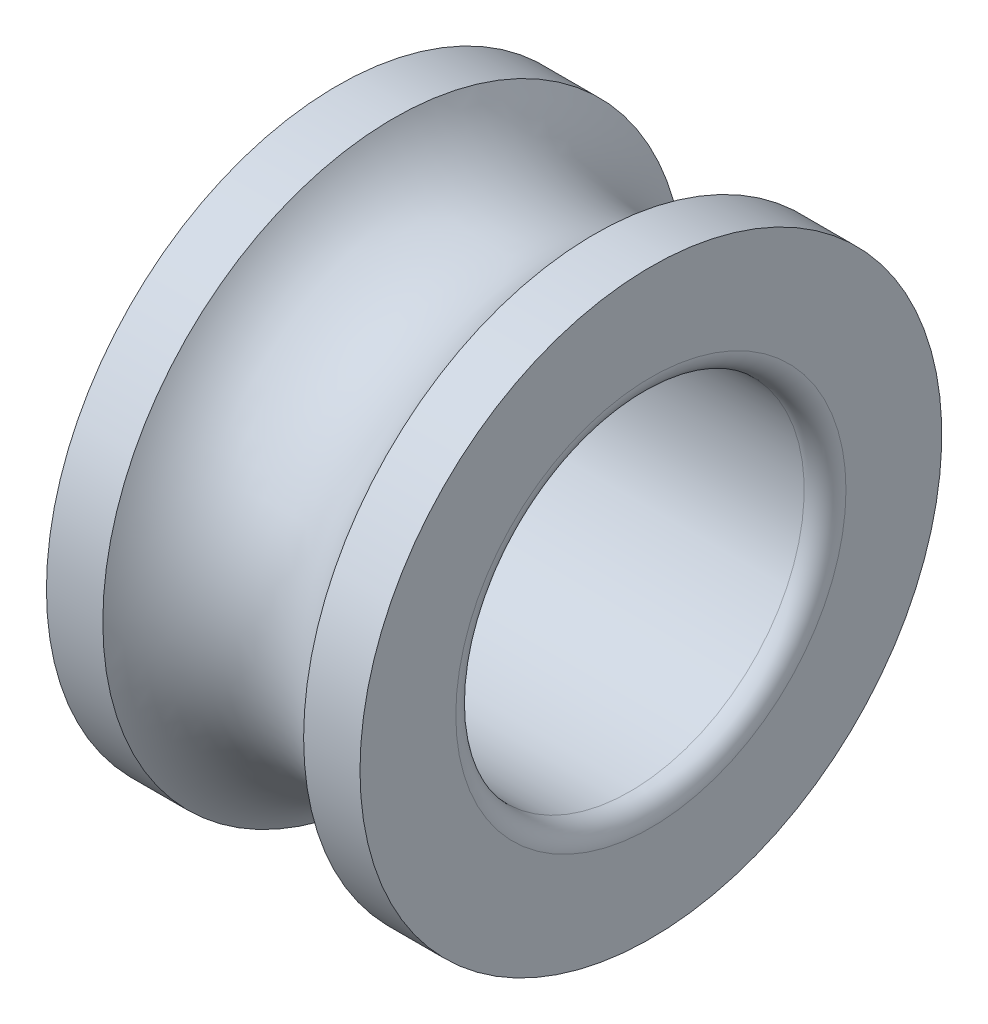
ISO-10303-21;
HEADER;
FILE_DESCRIPTION(('STEP AP214'),'2;1');
FILE_NAME('part.step','',(''),(''),'','','');
FILE_SCHEMA(('AUTOMOTIVE_DESIGN { 1 0 10303 214 1 1 1 1 }'));
ENDSEC;
DATA;
#1=APPLICATION_CONTEXT('core data for automotive mechanical design processes');
#2=APPLICATION_PROTOCOL_DEFINITION('international standard','automotive_design',2000,#1);
#3=PRODUCT_CONTEXT('',#1,'mechanical');
#4=PRODUCT('Part','Part','',(#3));
#5=PRODUCT_RELATED_PRODUCT_CATEGORY('part','',(#4));
#6=PRODUCT_DEFINITION_FORMATION('','',#4);
#7=PRODUCT_DEFINITION_CONTEXT('part definition',#1,'design');
#8=PRODUCT_DEFINITION('design','',#6,#7);
#9=PRODUCT_DEFINITION_SHAPE('','',#8);
#10=(LENGTH_UNIT() NAMED_UNIT(*) SI_UNIT(.MILLI.,.METRE.));
#11=(NAMED_UNIT(*) PLANE_ANGLE_UNIT() SI_UNIT($,.RADIAN.));
#12=(NAMED_UNIT(*) SI_UNIT($,.STERADIAN.) SOLID_ANGLE_UNIT());
#13=UNCERTAINTY_MEASURE_WITH_UNIT(LENGTH_MEASURE(1.E-05),#10,'distance_accuracy_value','');
#14=(GEOMETRIC_REPRESENTATION_CONTEXT(3) GLOBAL_UNCERTAINTY_ASSIGNED_CONTEXT((#13)) GLOBAL_UNIT_ASSIGNED_CONTEXT((#10,
#11,#12)) REPRESENTATION_CONTEXT('',''));
#15=CARTESIAN_POINT('',(0.,0.,0.));
#16=DIRECTION('',(0.,0.,1.));
#17=DIRECTION('',(1.,0.,0.));
#18=AXIS2_PLACEMENT_3D('',#15,#16,#17);
#19=CARTESIAN_POINT('',(0.,0.,0.));
#20=DIRECTION('',(-1.,0.,0.));
#21=DIRECTION('',(0.,0.,1.));
#22=AXIS2_PLACEMENT_3D('',#19,#20,#21);
#23=CYLINDRICAL_SURFACE('',#22,8.35);
#24=CARTESIAN_POINT('',(0.,0.,0.));
#25=DIRECTION('',(-1.,0.,0.));
#26=DIRECTION('',(0.,0.,1.));
#27=AXIS2_PLACEMENT_3D('',#24,#25,#26);
#28=CIRCLE('',#27,8.35);
#29=CARTESIAN_POINT('',(0.,0.,8.35));
#30=VERTEX_POINT('',#29);
#31=EDGE_CURVE('E10',#30,#30,#28,.T.);
#32=ORIENTED_EDGE('',*,*,#31,.F.);
#33=EDGE_LOOP('',(#32));
#34=FACE_BOUND('',#33,.T.);
#35=CARTESIAN_POINT('',(1.61807597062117,0.,0.));
#36=DIRECTION('',(-1.,0.,0.));
#37=DIRECTION('',(0.,0.,1.));
#38=AXIS2_PLACEMENT_3D('',#35,#36,#37);
#39=CIRCLE('',#38,8.35);
#40=CARTESIAN_POINT('',(1.61807597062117,0.,8.35));
#41=VERTEX_POINT('',#40);
#42=EDGE_CURVE('E43',#41,#41,#39,.T.);
#43=ORIENTED_EDGE('',*,*,#42,.T.);
#44=EDGE_LOOP('',(#43));
#45=FACE_BOUND('',#44,.T.);
#46=ADVANCED_FACE('F15',(#34,#45),#23,.T.);
#47=CARTESIAN_POINT('',(0.,8.35,0.));
#48=DIRECTION('',(1.,0.,0.));
#49=DIRECTION('',(0.,0.,-1.));
#50=AXIS2_PLACEMENT_3D('',#47,#48,#49);
#51=PLANE('',#50);
#52=CARTESIAN_POINT('',(0.,0.,0.));
#53=DIRECTION('',(-1.,0.,0.));
#54=DIRECTION('',(0.,0.,1.));
#55=AXIS2_PLACEMENT_3D('',#52,#53,#54);
#56=CIRCLE('',#55,5.6);
#57=CARTESIAN_POINT('',(0.,0.,5.6));
#58=VERTEX_POINT('',#57);
#59=EDGE_CURVE('E21',#58,#58,#56,.T.);
#60=ORIENTED_EDGE('',*,*,#59,.F.);
#61=EDGE_LOOP('',(#60));
#62=FACE_BOUND('',#61,.T.);
#63=ORIENTED_EDGE('',*,*,#31,.T.);
#64=EDGE_LOOP('',(#63));
#65=FACE_BOUND('',#64,.T.);
#66=ADVANCED_FACE('F61',(#62,#65),#51,.F.);
#67=CARTESIAN_POINT('',(0.6,0.,0.));
#68=DIRECTION('',(-1.,0.,0.));
#69=DIRECTION('',(0.,0.,1.));
#70=AXIS2_PLACEMENT_3D('',#67,#68,#69);
#71=TOROIDAL_SURFACE('',#70,5.6,0.6);
#72=CARTESIAN_POINT('',(0.6,0.,0.));
#73=DIRECTION('',(-1.,0.,0.));
#74=DIRECTION('',(0.,0.,1.));
#75=AXIS2_PLACEMENT_3D('',#72,#73,#74);
#76=CIRCLE('',#75,5.);
#77=CARTESIAN_POINT('',(0.6,0.,5.));
#78=VERTEX_POINT('',#77);
#79=EDGE_CURVE('E25',#78,#78,#76,.T.);
#80=ORIENTED_EDGE('',*,*,#79,.F.);
#81=EDGE_LOOP('',(#80));
#82=FACE_BOUND('',#81,.T.);
#83=ORIENTED_EDGE('',*,*,#59,.T.);
#84=EDGE_LOOP('',(#83));
#85=FACE_BOUND('',#84,.T.);
#86=ADVANCED_FACE('F66',(#82,#85),#71,.T.);
#87=CARTESIAN_POINT('',(0.,0.,0.));
#88=DIRECTION('',(-1.,0.,0.));
#89=DIRECTION('',(0.,0.,1.));
#90=AXIS2_PLACEMENT_3D('',#87,#88,#89);
#91=CYLINDRICAL_SURFACE('',#90,5.);
#92=CARTESIAN_POINT('',(8.4,0.,0.));
#93=DIRECTION('',(-1.,0.,0.));
#94=DIRECTION('',(0.,0.,1.));
#95=AXIS2_PLACEMENT_3D('',#92,#93,#94);
#96=CIRCLE('',#95,5.);
#97=CARTESIAN_POINT('',(8.4,0.,5.));
#98=VERTEX_POINT('',#97);
#99=EDGE_CURVE('E29',#98,#98,#96,.T.);
#100=ORIENTED_EDGE('',*,*,#99,.F.);
#101=EDGE_LOOP('',(#100));
#102=FACE_BOUND('',#101,.T.);
#103=ORIENTED_EDGE('',*,*,#79,.T.);
#104=EDGE_LOOP('',(#103));
#105=FACE_BOUND('',#104,.T.);
#106=ADVANCED_FACE('F71',(#102,#105),#91,.F.);
#107=CARTESIAN_POINT('',(8.4,0.,0.));
#108=DIRECTION('',(-1.,0.,0.));
#109=DIRECTION('',(0.,0.,1.));
#110=AXIS2_PLACEMENT_3D('',#107,#108,#109);
#111=TOROIDAL_SURFACE('',#110,5.6,0.6);
#112=CARTESIAN_POINT('',(9.,0.,0.));
#113=DIRECTION('',(-1.,0.,0.));
#114=DIRECTION('',(0.,0.,1.));
#115=AXIS2_PLACEMENT_3D('',#112,#113,#114);
#116=CIRCLE('',#115,5.6);
#117=CARTESIAN_POINT('',(9.,0.,5.6));
#118=VERTEX_POINT('',#117);
#119=EDGE_CURVE('E34',#118,#118,#116,.T.);
#120=ORIENTED_EDGE('',*,*,#119,.F.);
#121=EDGE_LOOP('',(#120));
#122=FACE_BOUND('',#121,.T.);
#123=ORIENTED_EDGE('',*,*,#99,.T.);
#124=EDGE_LOOP('',(#123));
#125=FACE_BOUND('',#124,.T.);
#126=ADVANCED_FACE('F77',(#122,#125),#111,.T.);
#127=CARTESIAN_POINT('',(9.,5.6,0.));
#128=DIRECTION('',(-1.,0.,0.));
#129=DIRECTION('',(0.,0.,1.));
#130=AXIS2_PLACEMENT_3D('',#127,#128,#129);
#131=PLANE('',#130);
#132=CARTESIAN_POINT('',(9.,0.,0.));
#133=DIRECTION('',(-1.,0.,0.));
#134=DIRECTION('',(0.,0.,1.));
#135=AXIS2_PLACEMENT_3D('',#132,#133,#134);
#136=CIRCLE('',#135,8.35);
#137=CARTESIAN_POINT('',(9.,0.,8.35));
#138=VERTEX_POINT('',#137);
#139=EDGE_CURVE('E37',#138,#138,#136,.T.);
#140=ORIENTED_EDGE('',*,*,#139,.F.);
#141=EDGE_LOOP('',(#140));
#142=FACE_BOUND('',#141,.T.);
#143=ORIENTED_EDGE('',*,*,#119,.T.);
#144=EDGE_LOOP('',(#143));
#145=FACE_BOUND('',#144,.T.);
#146=ADVANCED_FACE('F57',(#142,#145),#131,.F.);
#147=CARTESIAN_POINT('',(0.,0.,0.));
#148=DIRECTION('',(-1.,0.,0.));
#149=DIRECTION('',(0.,0.,1.));
#150=AXIS2_PLACEMENT_3D('',#147,#148,#149);
#151=CYLINDRICAL_SURFACE('',#150,8.35);
#152=CARTESIAN_POINT('',(7.38192402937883,0.,0.));
#153=DIRECTION('',(-1.,0.,0.));
#154=DIRECTION('',(0.,0.,1.));
#155=AXIS2_PLACEMENT_3D('',#152,#153,#154);
#156=CIRCLE('',#155,8.35);
#157=CARTESIAN_POINT('',(7.38192402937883,0.,8.35));
#158=VERTEX_POINT('',#157);
#159=EDGE_CURVE('E40',#158,#158,#156,.T.);
#160=ORIENTED_EDGE('',*,*,#159,.F.);
#161=EDGE_LOOP('',(#160));
#162=FACE_BOUND('',#161,.T.);
#163=ORIENTED_EDGE('',*,*,#139,.T.);
#164=EDGE_LOOP('',(#163));
#165=FACE_BOUND('',#164,.T.);
#166=ADVANCED_FACE('F50',(#162,#165),#151,.T.);
#167=CARTESIAN_POINT('',(4.5,0.,0.));
#168=DIRECTION('',(-1.,0.,0.));
#169=DIRECTION('',(0.,0.,1.));
#170=AXIS2_PLACEMENT_3D('',#167,#168,#169);
#171=TOROIDAL_SURFACE('',#170,10.025,3.33333333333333);
#172=ORIENTED_EDGE('',*,*,#159,.T.);
#173=EDGE_LOOP('',(#172));
#174=FACE_BOUND('',#173,.T.);
#175=ORIENTED_EDGE('',*,*,#42,.F.);
#176=EDGE_LOOP('',(#175));
#177=FACE_BOUND('',#176,.T.);
#178=ADVANCED_FACE('F48',(#174,#177),#171,.F.);
#179=CLOSED_SHELL('',(#46,#66,#86,#106,#126,#146,#166,#178));
#180=MANIFOLD_SOLID_BREP('B1',#179);
#181=ADVANCED_BREP_SHAPE_REPRESENTATION('',(#18,#180),#14);
#182=SHAPE_DEFINITION_REPRESENTATION(#9,#181);
ENDSEC;
END-ISO-10303-21;
